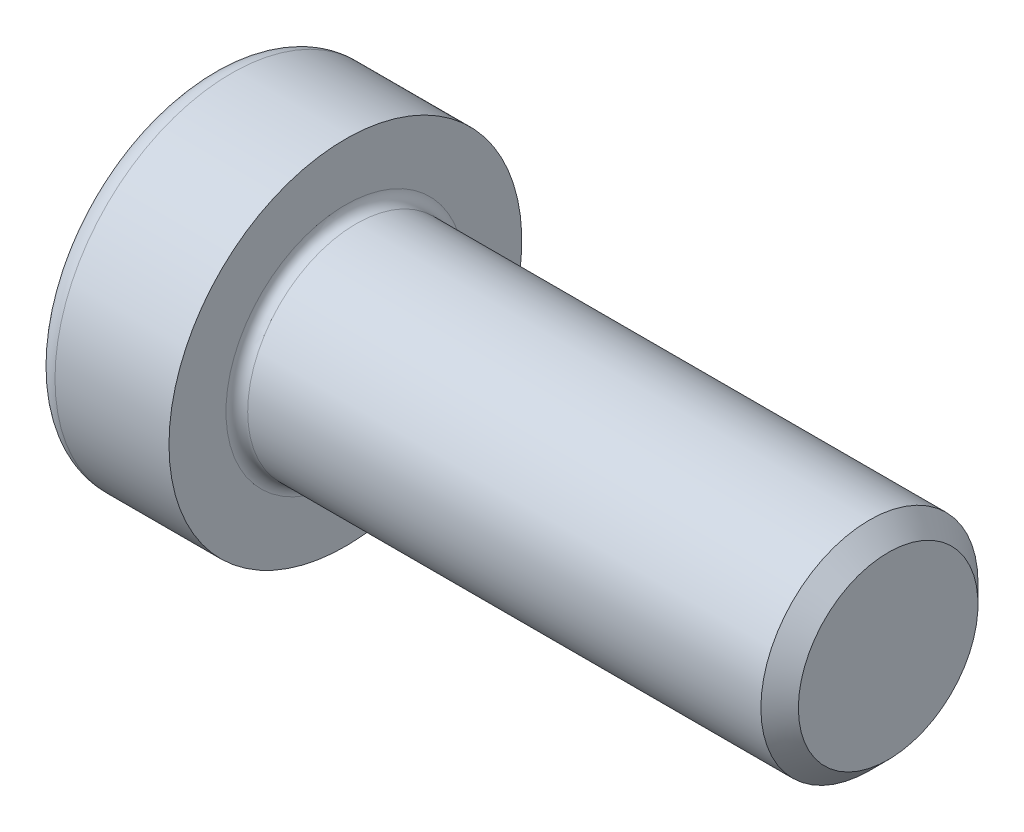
ISO-10303-21;
HEADER;
FILE_DESCRIPTION(('STEP AP214'),'2;1');
FILE_NAME('part.step','',(''),(''),'','','');
FILE_SCHEMA(('AUTOMOTIVE_DESIGN { 1 0 10303 214 1 1 1 1 }'));
ENDSEC;
DATA;
#1=APPLICATION_CONTEXT('core data for automotive mechanical design processes');
#2=APPLICATION_PROTOCOL_DEFINITION('international standard','automotive_design',2000,#1);
#3=PRODUCT_CONTEXT('',#1,'mechanical');
#4=PRODUCT('Part','Part','',(#3));
#5=PRODUCT_RELATED_PRODUCT_CATEGORY('part','',(#4));
#6=PRODUCT_DEFINITION_FORMATION('','',#4);
#7=PRODUCT_DEFINITION_CONTEXT('part definition',#1,'design');
#8=PRODUCT_DEFINITION('design','',#6,#7);
#9=PRODUCT_DEFINITION_SHAPE('','',#8);
#10=(LENGTH_UNIT() NAMED_UNIT(*) SI_UNIT(.MILLI.,.METRE.));
#11=(NAMED_UNIT(*) PLANE_ANGLE_UNIT() SI_UNIT($,.RADIAN.));
#12=(NAMED_UNIT(*) SI_UNIT($,.STERADIAN.) SOLID_ANGLE_UNIT());
#13=UNCERTAINTY_MEASURE_WITH_UNIT(LENGTH_MEASURE(1.E-05),#10,'distance_accuracy_value','');
#14=(GEOMETRIC_REPRESENTATION_CONTEXT(3) GLOBAL_UNCERTAINTY_ASSIGNED_CONTEXT((#13)) GLOBAL_UNIT_ASSIGNED_CONTEXT((#10,
#11,#12)) REPRESENTATION_CONTEXT('',''));
#15=CARTESIAN_POINT('',(0.,0.,0.));
#16=DIRECTION('',(0.,0.,1.));
#17=DIRECTION('',(1.,0.,0.));
#18=AXIS2_PLACEMENT_3D('',#15,#16,#17);
#19=CARTESIAN_POINT('',(0.,0.,0.));
#20=DIRECTION('',(-1.,0.,0.));
#21=DIRECTION('',(0.,0.,1.));
#22=AXIS2_PLACEMENT_3D('',#19,#20,#21);
#23=PLANE('',#22);
#24=DIRECTION('',(0.,-0.499999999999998,0.86602540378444));
#25=VECTOR('',#24,1.);
#26=CARTESIAN_POINT('',(0.,2.88675134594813,0.));
#27=LINE('',#26,#25);
#28=CARTESIAN_POINT('',(0.,2.88675134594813,0.));
#29=VERTEX_POINT('',#28);
#30=CARTESIAN_POINT('',(0.,1.44337567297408,2.49999999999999));
#31=VERTEX_POINT('',#30);
#32=EDGE_CURVE('E286',#29,#31,#27,.T.);
#33=ORIENTED_EDGE('',*,*,#32,.T.);
#34=DIRECTION('',(0.,1.,0.));
#35=VECTOR('',#34,1.);
#36=CARTESIAN_POINT('',(0.,-1.44337567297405,2.5));
#37=LINE('',#36,#35);
#38=CARTESIAN_POINT('',(0.,-1.44337567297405,2.5));
#39=VERTEX_POINT('',#38);
#40=EDGE_CURVE('E143',#39,#31,#37,.T.);
#41=ORIENTED_EDGE('',*,*,#40,.F.);
#42=DIRECTION('',(0.,-0.500000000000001,-0.866025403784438));
#43=VECTOR('',#42,1.);
#44=CARTESIAN_POINT('',(0.,-1.44337567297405,2.5));
#45=LINE('',#44,#43);
#46=CARTESIAN_POINT('',(0.,-2.88675134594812,0.));
#47=VERTEX_POINT('',#46);
#48=EDGE_CURVE('E291',#39,#47,#45,.T.);
#49=ORIENTED_EDGE('',*,*,#48,.T.);
#50=DIRECTION('',(0.,0.499999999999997,-0.86602540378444));
#51=VECTOR('',#50,1.);
#52=CARTESIAN_POINT('',(0.,-2.88675134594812,0.));
#53=LINE('',#52,#51);
#54=CARTESIAN_POINT('',(0.,-1.44337567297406,-2.5));
#55=VERTEX_POINT('',#54);
#56=EDGE_CURVE('E295',#47,#55,#53,.T.);
#57=ORIENTED_EDGE('',*,*,#56,.T.);
#58=DIRECTION('',(0.,-1.,0.));
#59=VECTOR('',#58,1.);
#60=CARTESIAN_POINT('',(0.,1.44337567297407,-2.50000000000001));
#61=LINE('',#60,#59);
#62=CARTESIAN_POINT('',(0.,1.44337567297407,-2.50000000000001));
#63=VERTEX_POINT('',#62);
#64=EDGE_CURVE('E299',#63,#55,#61,.T.);
#65=ORIENTED_EDGE('',*,*,#64,.F.);
#66=DIRECTION('',(0.,-0.500000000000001,-0.866025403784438));
#67=VECTOR('',#66,1.);
#68=CARTESIAN_POINT('',(0.,2.88675134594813,0.));
#69=LINE('',#68,#67);
#70=EDGE_CURVE('E138',#29,#63,#69,.T.);
#71=ORIENTED_EDGE('',*,*,#70,.F.);
#72=EDGE_LOOP('',(#33,#41,#49,#57,#65,#71));
#73=FACE_BOUND('',#72,.T.);
#74=CARTESIAN_POINT('',(0.,0.,0.));
#75=DIRECTION('',(-1.,0.,0.));
#76=DIRECTION('',(0.,0.,1.));
#77=AXIS2_PLACEMENT_3D('',#74,#75,#76);
#78=CIRCLE('',#77,5.7);
#79=CARTESIAN_POINT('',(0.,0.,5.7));
#80=VERTEX_POINT('',#79);
#81=EDGE_CURVE('E53',#80,#80,#78,.T.);
#82=ORIENTED_EDGE('',*,*,#81,.T.);
#83=EDGE_LOOP('',(#82));
#84=FACE_BOUND('',#83,.T.);
#85=ADVANCED_FACE('F44',(#73,#84),#23,.T.);
#86=CARTESIAN_POINT('',(-31.75,0.,0.));
#87=DIRECTION('',(-1.,0.,0.));
#88=DIRECTION('',(0.,0.,1.));
#89=AXIS2_PLACEMENT_3D('',#86,#87,#88);
#90=CYLINDRICAL_SURFACE('',#89,6.5);
#91=CARTESIAN_POINT('',(0.800000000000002,0.,0.));
#92=DIRECTION('',(-1.,0.,0.));
#93=DIRECTION('',(0.,0.,1.));
#94=AXIS2_PLACEMENT_3D('',#91,#92,#93);
#95=CIRCLE('',#94,6.5);
#96=CARTESIAN_POINT('',(0.800000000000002,0.,6.5));
#97=VERTEX_POINT('',#96);
#98=EDGE_CURVE('E11',#97,#97,#95,.F.);
#99=ORIENTED_EDGE('',*,*,#98,.T.);
#100=EDGE_LOOP('',(#99));
#101=FACE_BOUND('',#100,.T.);
#102=CARTESIAN_POINT('',(5.,0.,0.));
#103=DIRECTION('',(-1.,0.,0.));
#104=DIRECTION('',(0.,0.,1.));
#105=AXIS2_PLACEMENT_3D('',#102,#103,#104);
#106=CIRCLE('',#105,6.5);
#107=CARTESIAN_POINT('',(5.,0.,6.5));
#108=VERTEX_POINT('',#107);
#109=EDGE_CURVE('E167',#108,#108,#106,.T.);
#110=ORIENTED_EDGE('',*,*,#109,.T.);
#111=EDGE_LOOP('',(#110));
#112=FACE_BOUND('',#111,.T.);
#113=ADVANCED_FACE('F195',(#101,#112),#90,.T.);
#114=CARTESIAN_POINT('',(5.,6.5,0.));
#115=DIRECTION('',(1.,0.,0.));
#116=DIRECTION('',(0.,0.,-1.));
#117=AXIS2_PLACEMENT_3D('',#114,#115,#116);
#118=PLANE('',#117);
#119=CARTESIAN_POINT('',(5.,0.,0.));
#120=DIRECTION('',(1.,0.,0.));
#121=DIRECTION('',(0.,0.,-1.));
#122=AXIS2_PLACEMENT_3D('',#119,#120,#121);
#123=CIRCLE('',#122,4.4);
#124=CARTESIAN_POINT('',(5.,0.,-4.4));
#125=VERTEX_POINT('',#124);
#126=EDGE_CURVE('E171',#125,#125,#123,.F.);
#127=ORIENTED_EDGE('',*,*,#126,.T.);
#128=EDGE_LOOP('',(#127));
#129=FACE_BOUND('',#128,.T.);
#130=ORIENTED_EDGE('',*,*,#109,.F.);
#131=EDGE_LOOP('',(#130));
#132=FACE_BOUND('',#131,.T.);
#133=ADVANCED_FACE('F201',(#129,#132),#118,.T.);
#134=CARTESIAN_POINT('',(-31.75,0.,0.));
#135=DIRECTION('',(-1.,0.,0.));
#136=DIRECTION('',(0.,0.,1.));
#137=AXIS2_PLACEMENT_3D('',#134,#135,#136);
#138=CYLINDRICAL_SURFACE('',#137,4.);
#139=CARTESIAN_POINT('',(5.4,0.,0.));
#140=DIRECTION('',(1.,0.,0.));
#141=DIRECTION('',(0.,0.,-1.));
#142=AXIS2_PLACEMENT_3D('',#139,#140,#141);
#143=CIRCLE('',#142,4.);
#144=CARTESIAN_POINT('',(5.4,0.,-4.));
#145=VERTEX_POINT('',#144);
#146=EDGE_CURVE('E175',#145,#145,#143,.T.);
#147=ORIENTED_EDGE('',*,*,#146,.T.);
#148=EDGE_LOOP('',(#147));
#149=FACE_BOUND('',#148,.T.);
#150=CARTESIAN_POINT('',(24.3095,0.,0.));
#151=DIRECTION('',(-1.,0.,0.));
#152=DIRECTION('',(0.,0.,1.));
#153=AXIS2_PLACEMENT_3D('',#150,#151,#152);
#154=CIRCLE('',#153,4.);
#155=CARTESIAN_POINT('',(24.3095,0.,4.));
#156=VERTEX_POINT('',#155);
#157=EDGE_CURVE('E163',#156,#156,#154,.T.);
#158=ORIENTED_EDGE('',*,*,#157,.T.);
#159=EDGE_LOOP('',(#158));
#160=FACE_BOUND('',#159,.T.);
#161=ADVANCED_FACE('F207',(#149,#160),#138,.T.);
#162=CARTESIAN_POINT('',(25.,0.,0.));
#163=DIRECTION('',(-1.,0.,0.));
#164=DIRECTION('',(0.,0.,1.));
#165=AXIS2_PLACEMENT_3D('',#162,#163,#164);
#166=CONICAL_SURFACE('',#165,3.3095,0.785398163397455);
#167=ORIENTED_EDGE('',*,*,#157,.F.);
#168=EDGE_LOOP('',(#167));
#169=FACE_BOUND('',#168,.T.);
#170=CARTESIAN_POINT('',(25.,0.,0.));
#171=DIRECTION('',(-1.,0.,0.));
#172=DIRECTION('',(0.,0.,1.));
#173=AXIS2_PLACEMENT_3D('',#170,#171,#172);
#174=CIRCLE('',#173,3.3095);
#175=CARTESIAN_POINT('',(25.,0.,3.3095));
#176=VERTEX_POINT('',#175);
#177=EDGE_CURVE('E158',#176,#176,#174,.T.);
#178=ORIENTED_EDGE('',*,*,#177,.T.);
#179=EDGE_LOOP('',(#178));
#180=FACE_BOUND('',#179,.T.);
#181=ADVANCED_FACE('F211',(#169,#180),#166,.T.);
#182=CARTESIAN_POINT('',(25.,3.3095,0.));
#183=DIRECTION('',(1.,0.,0.));
#184=DIRECTION('',(0.,0.,-1.));
#185=AXIS2_PLACEMENT_3D('',#182,#183,#184);
#186=PLANE('',#185);
#187=ORIENTED_EDGE('',*,*,#177,.F.);
#188=EDGE_LOOP('',(#187));
#189=FACE_BOUND('',#188,.T.);
#190=ADVANCED_FACE('F191',(#189),#186,.T.);
#191=CARTESIAN_POINT('',(5.4,0.,0.));
#192=DIRECTION('',(1.,0.,0.));
#193=DIRECTION('',(0.,0.,-1.));
#194=AXIS2_PLACEMENT_3D('',#191,#192,#193);
#195=TOROIDAL_SURFACE('',#194,4.4,0.4);
#196=ORIENTED_EDGE('',*,*,#146,.F.);
#197=EDGE_LOOP('',(#196));
#198=FACE_BOUND('',#197,.T.);
#199=ORIENTED_EDGE('',*,*,#126,.F.);
#200=EDGE_LOOP('',(#199));
#201=FACE_BOUND('',#200,.T.);
#202=ADVANCED_FACE('F184',(#198,#201),#195,.F.);
#203=CARTESIAN_POINT('',(0.800000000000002,0.,0.));
#204=DIRECTION('',(-1.,0.,0.));
#205=DIRECTION('',(0.,0.,1.));
#206=AXIS2_PLACEMENT_3D('',#203,#204,#205);
#207=TOROIDAL_SURFACE('',#206,5.7,0.8);
#208=ORIENTED_EDGE('',*,*,#98,.F.);
#209=EDGE_LOOP('',(#208));
#210=FACE_BOUND('',#209,.T.);
#211=ORIENTED_EDGE('',*,*,#81,.F.);
#212=EDGE_LOOP('',(#211));
#213=FACE_BOUND('',#212,.T.);
#214=ADVANCED_FACE('F46',(#210,#213),#207,.T.);
#215=CARTESIAN_POINT('',(3.8,2.88675134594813,0.));
#216=DIRECTION('',(0.,-0.86602540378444,-0.499999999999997));
#217=DIRECTION('',(0.,0.499999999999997,-0.86602540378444));
#218=AXIS2_PLACEMENT_3D('',#215,#216,#217);
#219=PLANE('',#218);
#220=ORIENTED_EDGE('',*,*,#32,.F.);
#221=DIRECTION('',(-1.,0.,0.));
#222=VECTOR('',#221,1.);
#223=CARTESIAN_POINT('',(3.8,2.88675134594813,0.));
#224=LINE('',#223,#222);
#225=CARTESIAN_POINT('',(3.8,2.88675134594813,0.));
#226=VERTEX_POINT('',#225);
#227=EDGE_CURVE('E273',#226,#29,#224,.T.);
#228=ORIENTED_EDGE('',*,*,#227,.F.);
#229=DIRECTION('',(0.,-0.499999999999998,0.86602540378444));
#230=VECTOR('',#229,1.);
#231=CARTESIAN_POINT('',(3.8,2.88675134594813,0.));
#232=LINE('',#231,#230);
#233=CARTESIAN_POINT('',(3.8,2.1650635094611,1.25));
#234=VERTEX_POINT('',#233);
#235=EDGE_CURVE('E129',#226,#234,#232,.T.);
#236=ORIENTED_EDGE('',*,*,#235,.T.);
#237=CARTESIAN_POINT('',(3.8,1.44337567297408,2.49999999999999));
#238=VERTEX_POINT('',#237);
#239=EDGE_CURVE('E119',#234,#238,#232,.T.);
#240=ORIENTED_EDGE('',*,*,#239,.T.);
#241=DIRECTION('',(-1.,0.,0.));
#242=VECTOR('',#241,1.);
#243=CARTESIAN_POINT('',(3.8,1.44337567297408,2.49999999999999));
#244=LINE('',#243,#242);
#245=EDGE_CURVE('E134',#238,#31,#244,.T.);
#246=ORIENTED_EDGE('',*,*,#245,.T.);
#247=EDGE_LOOP('',(#220,#228,#236,#240,#246));
#248=FACE_BOUND('',#247,.T.);
#249=ADVANCED_FACE('F133',(#248),#219,.T.);
#250=CARTESIAN_POINT('',(3.8,-1.44337567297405,2.5));
#251=DIRECTION('',(0.,0.,1.));
#252=DIRECTION('',(0.,-1.,0.));
#253=AXIS2_PLACEMENT_3D('',#250,#251,#252);
#254=PLANE('',#253);
#255=ORIENTED_EDGE('',*,*,#40,.T.);
#256=ORIENTED_EDGE('',*,*,#245,.F.);
#257=DIRECTION('',(0.,1.,0.));
#258=VECTOR('',#257,1.);
#259=CARTESIAN_POINT('',(3.8,-1.44337567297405,2.5));
#260=LINE('',#259,#258);
#261=CARTESIAN_POINT('',(3.8,0.,2.5));
#262=VERTEX_POINT('',#261);
#263=EDGE_CURVE('E116',#262,#238,#260,.T.);
#264=ORIENTED_EDGE('',*,*,#263,.F.);
#265=CARTESIAN_POINT('',(3.8,-1.44337567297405,2.5));
#266=VERTEX_POINT('',#265);
#267=EDGE_CURVE('E128',#266,#262,#260,.T.);
#268=ORIENTED_EDGE('',*,*,#267,.F.);
#269=DIRECTION('',(-1.,0.,0.));
#270=VECTOR('',#269,1.);
#271=CARTESIAN_POINT('',(3.8,-1.44337567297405,2.5));
#272=LINE('',#271,#270);
#273=EDGE_CURVE('E146',#266,#39,#272,.T.);
#274=ORIENTED_EDGE('',*,*,#273,.T.);
#275=EDGE_LOOP('',(#255,#256,#264,#268,#274));
#276=FACE_BOUND('',#275,.T.);
#277=ADVANCED_FACE('F140',(#276),#254,.F.);
#278=CARTESIAN_POINT('',(3.8,-1.44337567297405,2.5));
#279=DIRECTION('',(0.,0.866025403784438,-0.500000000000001));
#280=DIRECTION('',(0.,0.500000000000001,0.866025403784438));
#281=AXIS2_PLACEMENT_3D('',#278,#279,#280);
#282=PLANE('',#281);
#283=ORIENTED_EDGE('',*,*,#48,.F.);
#284=ORIENTED_EDGE('',*,*,#273,.F.);
#285=DIRECTION('',(0.,-0.500000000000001,-0.866025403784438));
#286=VECTOR('',#285,1.);
#287=CARTESIAN_POINT('',(3.8,-1.44337567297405,2.5));
#288=LINE('',#287,#286);
#289=CARTESIAN_POINT('',(3.8,-2.16506350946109,1.25));
#290=VERTEX_POINT('',#289);
#291=EDGE_CURVE('E329',#266,#290,#288,.T.);
#292=ORIENTED_EDGE('',*,*,#291,.T.);
#293=CARTESIAN_POINT('',(3.8,-2.88675134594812,0.));
#294=VERTEX_POINT('',#293);
#295=EDGE_CURVE('E313',#290,#294,#288,.T.);
#296=ORIENTED_EDGE('',*,*,#295,.T.);
#297=DIRECTION('',(-1.,0.,0.));
#298=VECTOR('',#297,1.);
#299=CARTESIAN_POINT('',(3.8,-2.88675134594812,0.));
#300=LINE('',#299,#298);
#301=EDGE_CURVE('E153',#294,#47,#300,.T.);
#302=ORIENTED_EDGE('',*,*,#301,.T.);
#303=EDGE_LOOP('',(#283,#284,#292,#296,#302));
#304=FACE_BOUND('',#303,.T.);
#305=ADVANCED_FACE('F225',(#304),#282,.T.);
#306=CARTESIAN_POINT('',(3.8,-2.88675134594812,0.));
#307=DIRECTION('',(0.,0.86602540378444,0.499999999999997));
#308=DIRECTION('',(0.,-0.499999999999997,0.86602540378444));
#309=AXIS2_PLACEMENT_3D('',#306,#307,#308);
#310=PLANE('',#309);
#311=ORIENTED_EDGE('',*,*,#56,.F.);
#312=ORIENTED_EDGE('',*,*,#301,.F.);
#313=DIRECTION('',(0.,0.499999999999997,-0.86602540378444));
#314=VECTOR('',#313,1.);
#315=CARTESIAN_POINT('',(3.8,-2.88675134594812,0.));
#316=LINE('',#315,#314);
#317=CARTESIAN_POINT('',(3.8,-2.1650635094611,-1.24999999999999));
#318=VERTEX_POINT('',#317);
#319=EDGE_CURVE('E281',#294,#318,#316,.T.);
#320=ORIENTED_EDGE('',*,*,#319,.T.);
#321=CARTESIAN_POINT('',(3.8,-1.44337567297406,-2.5));
#322=VERTEX_POINT('',#321);
#323=EDGE_CURVE('E327',#318,#322,#316,.T.);
#324=ORIENTED_EDGE('',*,*,#323,.T.);
#325=DIRECTION('',(-1.,0.,0.));
#326=VECTOR('',#325,1.);
#327=CARTESIAN_POINT('',(3.8,-1.44337567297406,-2.5));
#328=LINE('',#327,#326);
#329=EDGE_CURVE('E272',#322,#55,#328,.T.);
#330=ORIENTED_EDGE('',*,*,#329,.T.);
#331=EDGE_LOOP('',(#311,#312,#320,#324,#330));
#332=FACE_BOUND('',#331,.T.);
#333=ADVANCED_FACE('F228',(#332),#310,.T.);
#334=CARTESIAN_POINT('',(3.8,1.44337567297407,-2.50000000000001));
#335=DIRECTION('',(0.,0.,-1.));
#336=DIRECTION('',(0.,1.,0.));
#337=AXIS2_PLACEMENT_3D('',#334,#335,#336);
#338=PLANE('',#337);
#339=ORIENTED_EDGE('',*,*,#64,.T.);
#340=ORIENTED_EDGE('',*,*,#329,.F.);
#341=DIRECTION('',(0.,-1.,0.));
#342=VECTOR('',#341,1.);
#343=CARTESIAN_POINT('',(3.8,1.44337567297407,-2.50000000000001));
#344=LINE('',#343,#342);
#345=CARTESIAN_POINT('',(3.8,0.,-2.5));
#346=VERTEX_POINT('',#345);
#347=EDGE_CURVE('E276',#346,#322,#344,.T.);
#348=ORIENTED_EDGE('',*,*,#347,.F.);
#349=CARTESIAN_POINT('',(3.8,1.44337567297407,-2.50000000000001));
#350=VERTEX_POINT('',#349);
#351=EDGE_CURVE('E60',#350,#346,#344,.T.);
#352=ORIENTED_EDGE('',*,*,#351,.F.);
#353=DIRECTION('',(-1.,0.,0.));
#354=VECTOR('',#353,1.);
#355=CARTESIAN_POINT('',(3.8,1.44337567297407,-2.50000000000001));
#356=LINE('',#355,#354);
#357=EDGE_CURVE('E268',#350,#63,#356,.T.);
#358=ORIENTED_EDGE('',*,*,#357,.T.);
#359=EDGE_LOOP('',(#339,#340,#348,#352,#358));
#360=FACE_BOUND('',#359,.T.);
#361=ADVANCED_FACE('F232',(#360),#338,.F.);
#362=CARTESIAN_POINT('',(3.8,2.88675134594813,0.));
#363=DIRECTION('',(0.,0.866025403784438,-0.500000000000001));
#364=DIRECTION('',(0.,0.500000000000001,0.866025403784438));
#365=AXIS2_PLACEMENT_3D('',#362,#363,#364);
#366=PLANE('',#365);
#367=ORIENTED_EDGE('',*,*,#70,.T.);
#368=ORIENTED_EDGE('',*,*,#357,.F.);
#369=DIRECTION('',(0.,-0.500000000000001,-0.866025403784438));
#370=VECTOR('',#369,1.);
#371=CARTESIAN_POINT('',(3.8,2.88675134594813,0.));
#372=LINE('',#371,#370);
#373=CARTESIAN_POINT('',(3.8,2.1650635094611,-1.25000000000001));
#374=VERTEX_POINT('',#373);
#375=EDGE_CURVE('E257',#374,#350,#372,.T.);
#376=ORIENTED_EDGE('',*,*,#375,.F.);
#377=EDGE_CURVE('E264',#226,#374,#372,.T.);
#378=ORIENTED_EDGE('',*,*,#377,.F.);
#379=ORIENTED_EDGE('',*,*,#227,.T.);
#380=EDGE_LOOP('',(#367,#368,#376,#378,#379));
#381=FACE_BOUND('',#380,.T.);
#382=ADVANCED_FACE('F236',(#381),#366,.F.);
#383=CARTESIAN_POINT('',(3.8,4.33012701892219,-2.50000000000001));
#384=DIRECTION('',(1.,0.,0.));
#385=DIRECTION('',(0.,0.,-1.));
#386=AXIS2_PLACEMENT_3D('',#383,#384,#385);
#387=PLANE('',#386);
#388=ORIENTED_EDGE('',*,*,#347,.T.);
#389=ORIENTED_EDGE('',*,*,#323,.F.);
#390=CARTESIAN_POINT('',(3.8,0.,0.));
#391=DIRECTION('',(-1.,0.,0.));
#392=DIRECTION('',(0.,0.,1.));
#393=AXIS2_PLACEMENT_3D('',#390,#391,#392);
#394=CIRCLE('',#393,2.5);
#395=EDGE_CURVE('E321',#346,#318,#394,.T.);
#396=ORIENTED_EDGE('',*,*,#395,.F.);
#397=EDGE_LOOP('',(#388,#389,#396));
#398=FACE_BOUND('',#397,.T.);
#399=ADVANCED_FACE('F240',(#398),#387,.F.);
#400=ORIENTED_EDGE('',*,*,#319,.F.);
#401=ORIENTED_EDGE('',*,*,#295,.F.);
#402=EDGE_CURVE('E151',#318,#290,#394,.T.);
#403=ORIENTED_EDGE('',*,*,#402,.F.);
#404=EDGE_LOOP('',(#400,#401,#403));
#405=FACE_BOUND('',#404,.T.);
#406=ADVANCED_FACE('F243',(#405),#387,.F.);
#407=ORIENTED_EDGE('',*,*,#291,.F.);
#408=ORIENTED_EDGE('',*,*,#267,.T.);
#409=EDGE_CURVE('E145',#290,#262,#394,.T.);
#410=ORIENTED_EDGE('',*,*,#409,.F.);
#411=EDGE_LOOP('',(#407,#408,#410));
#412=FACE_BOUND('',#411,.T.);
#413=ADVANCED_FACE('F248',(#412),#387,.F.);
#414=ORIENTED_EDGE('',*,*,#263,.T.);
#415=ORIENTED_EDGE('',*,*,#239,.F.);
#416=EDGE_CURVE('E122',#262,#234,#394,.T.);
#417=ORIENTED_EDGE('',*,*,#416,.F.);
#418=EDGE_LOOP('',(#414,#415,#417));
#419=FACE_BOUND('',#418,.T.);
#420=ADVANCED_FACE('F118',(#419),#387,.F.);
#421=ORIENTED_EDGE('',*,*,#235,.F.);
#422=ORIENTED_EDGE('',*,*,#377,.T.);
#423=EDGE_CURVE('E159',#234,#374,#394,.T.);
#424=ORIENTED_EDGE('',*,*,#423,.F.);
#425=EDGE_LOOP('',(#421,#422,#424));
#426=FACE_BOUND('',#425,.T.);
#427=ADVANCED_FACE('F251',(#426),#387,.F.);
#428=ORIENTED_EDGE('',*,*,#375,.T.);
#429=ORIENTED_EDGE('',*,*,#351,.T.);
#430=EDGE_CURVE('E260',#374,#346,#394,.T.);
#431=ORIENTED_EDGE('',*,*,#430,.F.);
#432=EDGE_LOOP('',(#428,#429,#431));
#433=FACE_BOUND('',#432,.T.);
#434=ADVANCED_FACE('F221',(#433),#387,.F.);
#435=CARTESIAN_POINT('',(3.8,0.,0.));
#436=DIRECTION('',(-1.,0.,0.));
#437=DIRECTION('',(0.,0.,1.));
#438=AXIS2_PLACEMENT_3D('',#435,#436,#437);
#439=CONICAL_SURFACE('',#438,2.5,1.04719755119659);
#440=CARTESIAN_POINT('',(5.24337567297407,0.,0.));
#441=VERTEX_POINT('',#440);
#442=VERTEX_LOOP('',#441);
#443=FACE_BOUND('',#442,.T.);
#444=ORIENTED_EDGE('',*,*,#416,.T.);
#445=ORIENTED_EDGE('',*,*,#423,.T.);
#446=ORIENTED_EDGE('',*,*,#430,.T.);
#447=ORIENTED_EDGE('',*,*,#395,.T.);
#448=ORIENTED_EDGE('',*,*,#402,.T.);
#449=ORIENTED_EDGE('',*,*,#409,.T.);
#450=EDGE_LOOP('',(#444,#445,#446,#447,#448,#449));
#451=FACE_BOUND('',#450,.T.);
#452=ADVANCED_FACE('F219',(#443,#451),#439,.F.);
#453=CLOSED_SHELL('',(#85,#113,#133,#161,#181,#190,#202,#214,#249,#277,#305,#333,#361,#382,#399,
#406,#413,#420,#427,#434,#452));
#454=MANIFOLD_SOLID_BREP('B2',#453);
#455=ADVANCED_BREP_SHAPE_REPRESENTATION('',(#18,#454),#14);
#456=SHAPE_DEFINITION_REPRESENTATION(#9,#455);
ENDSEC;
END-ISO-10303-21;
